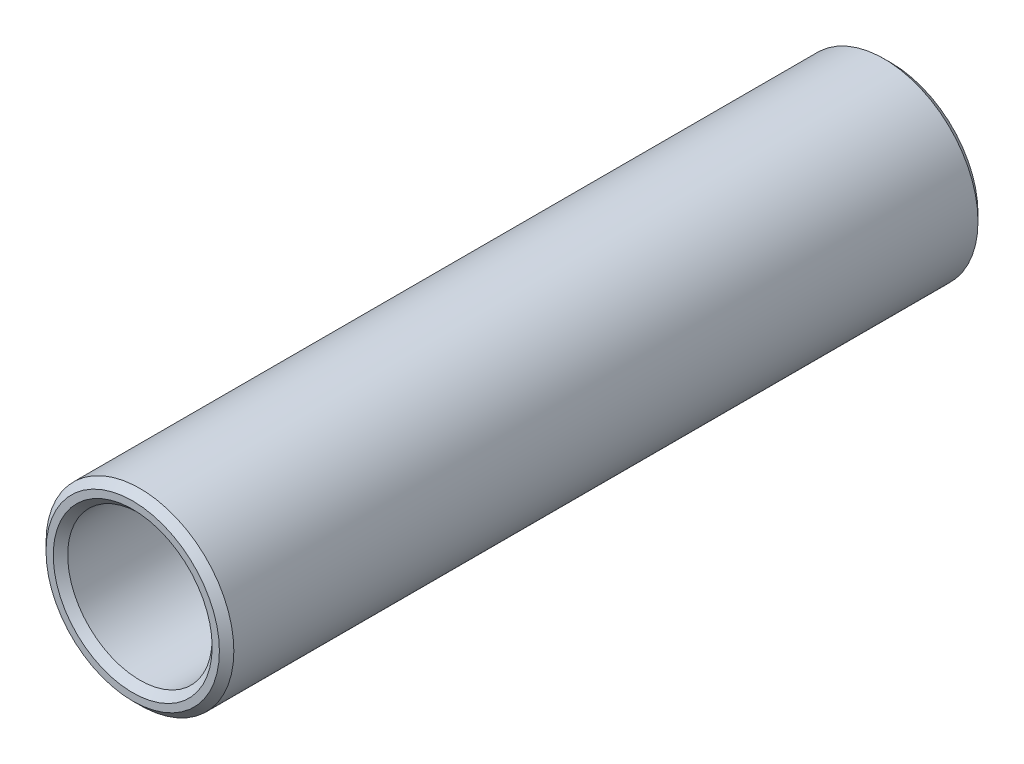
ISO-10303-21;
HEADER;
FILE_DESCRIPTION(('STEP AP214'),'2;1');
FILE_NAME('part.step','',(''),(''),'','','');
FILE_SCHEMA(('AUTOMOTIVE_DESIGN { 1 0 10303 214 1 1 1 1 }'));
ENDSEC;
DATA;
#1=APPLICATION_CONTEXT('core data for automotive mechanical design processes');
#2=APPLICATION_PROTOCOL_DEFINITION('international standard','automotive_design',2000,#1);
#3=PRODUCT_CONTEXT('',#1,'mechanical');
#4=PRODUCT('Part','Part','',(#3));
#5=PRODUCT_RELATED_PRODUCT_CATEGORY('part','',(#4));
#6=PRODUCT_DEFINITION_FORMATION('','',#4);
#7=PRODUCT_DEFINITION_CONTEXT('part definition',#1,'design');
#8=PRODUCT_DEFINITION('design','',#6,#7);
#9=PRODUCT_DEFINITION_SHAPE('','',#8);
#10=(LENGTH_UNIT() NAMED_UNIT(*) SI_UNIT(.MILLI.,.METRE.));
#11=(NAMED_UNIT(*) PLANE_ANGLE_UNIT() SI_UNIT($,.RADIAN.));
#12=(NAMED_UNIT(*) SI_UNIT($,.STERADIAN.) SOLID_ANGLE_UNIT());
#13=UNCERTAINTY_MEASURE_WITH_UNIT(LENGTH_MEASURE(1.E-05),#10,'distance_accuracy_value','');
#14=(GEOMETRIC_REPRESENTATION_CONTEXT(3) GLOBAL_UNCERTAINTY_ASSIGNED_CONTEXT((#13)) GLOBAL_UNIT_ASSIGNED_CONTEXT((#10,
#11,#12)) REPRESENTATION_CONTEXT('',''));
#15=CARTESIAN_POINT('',(0.,0.,0.));
#16=DIRECTION('',(0.,0.,1.));
#17=DIRECTION('',(1.,0.,0.));
#18=AXIS2_PLACEMENT_3D('',#15,#16,#17);
#19=CARTESIAN_POINT('',(-1.60982338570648E-12,0.,105.00000000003));
#20=DIRECTION('',(0.,0.,1.00000000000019));
#21=DIRECTION('',(1.,0.,0.));
#22=AXIS2_PLACEMENT_3D('',#19,#20,#21);
#23=PLANE('',#22);
#24=CARTESIAN_POINT('',(-1.60982338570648E-12,0.,105.00000000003));
#25=DIRECTION('',(0.,0.,1.00000000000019));
#26=DIRECTION('',(1.,0.,0.));
#27=AXIS2_PLACEMENT_3D('',#24,#25,#26);
#28=CIRCLE('',#27,11.);
#29=CARTESIAN_POINT('',(10.9999999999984,8.02635735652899E-13,105.00000000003));
#30=VERTEX_POINT('',#29);
#31=EDGE_CURVE('E55',#30,#30,#28,.F.);
#32=ORIENTED_EDGE('',*,*,#31,.T.);
#33=EDGE_LOOP('',(#32));
#34=FACE_BOUND('',#33,.T.);
#35=CARTESIAN_POINT('',(-1.60982338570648E-12,0.,105.00000000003));
#36=DIRECTION('',(0.,0.,1.00000000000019));
#37=DIRECTION('',(1.,0.,0.));
#38=AXIS2_PLACEMENT_3D('',#35,#36,#37);
#39=CIRCLE('',#38,12.);
#40=CARTESIAN_POINT('',(11.9999999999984,8.73079386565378E-13,105.00000000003));
#41=VERTEX_POINT('',#40);
#42=EDGE_CURVE('E58',#41,#41,#39,.T.);
#43=ORIENTED_EDGE('',*,*,#42,.T.);
#44=EDGE_LOOP('',(#43));
#45=FACE_BOUND('',#44,.T.);
#46=ADVANCED_FACE('F35',(#34,#45),#23,.T.);
#47=CARTESIAN_POINT('',(0.,1.11022302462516E-13,0.));
#48=DIRECTION('',(0.,0.,1.00000000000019));
#49=DIRECTION('',(1.,0.,0.));
#50=AXIS2_PLACEMENT_3D('',#47,#48,#49);
#51=PLANE('',#50);
#52=CARTESIAN_POINT('',(0.,1.11022302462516E-13,0.));
#53=DIRECTION('',(0.,0.,1.00000000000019));
#54=DIRECTION('',(1.,0.,0.));
#55=AXIS2_PLACEMENT_3D('',#52,#53,#54);
#56=CIRCLE('',#55,11.);
#57=CARTESIAN_POINT('',(11.,8.85902462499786E-13,0.));
#58=VERTEX_POINT('',#57);
#59=EDGE_CURVE('E10',#58,#58,#56,.T.);
#60=ORIENTED_EDGE('',*,*,#59,.T.);
#61=EDGE_LOOP('',(#60));
#62=FACE_BOUND('',#61,.T.);
#63=CARTESIAN_POINT('',(0.,1.11022302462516E-13,0.));
#64=DIRECTION('',(0.,0.,1.00000000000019));
#65=DIRECTION('',(1.,0.,0.));
#66=AXIS2_PLACEMENT_3D('',#63,#64,#65);
#67=CIRCLE('',#66,12.);
#68=CARTESIAN_POINT('',(12.,9.56346113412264E-13,0.));
#69=VERTEX_POINT('',#68);
#70=EDGE_CURVE('E42',#69,#69,#67,.F.);
#71=ORIENTED_EDGE('',*,*,#70,.T.);
#72=EDGE_LOOP('',(#71));
#73=FACE_BOUND('',#72,.T.);
#74=ADVANCED_FACE('F86',(#62,#73),#51,.F.);
#75=CARTESIAN_POINT('',(-1.60982338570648E-12,0.,105.00000000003));
#76=DIRECTION('',(0.,0.,-1.00000000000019));
#77=DIRECTION('',(-1.,0.,0.));
#78=AXIS2_PLACEMENT_3D('',#75,#76,#77);
#79=CYLINDRICAL_SURFACE('',#78,13.);
#80=CARTESIAN_POINT('',(0.,0.,104.00000000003));
#81=DIRECTION('',(0.,0.,1.00000000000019));
#82=DIRECTION('',(1.,0.,0.));
#83=AXIS2_PLACEMENT_3D('',#80,#81,#82);
#84=CIRCLE('',#83,13.);
#85=CARTESIAN_POINT('',(12.9999999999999,9.43523037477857E-13,104.00000000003));
#86=VERTEX_POINT('',#85);
#87=EDGE_CURVE('E46',#86,#86,#84,.F.);
#88=ORIENTED_EDGE('',*,*,#87,.T.);
#89=EDGE_LOOP('',(#88));
#90=FACE_BOUND('',#89,.T.);
#91=CARTESIAN_POINT('',(-4.02455846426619E-12,6.80011602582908E-13,1.));
#92=DIRECTION('',(0.,0.,1.00000000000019));
#93=DIRECTION('',(1.,0.,0.));
#94=AXIS2_PLACEMENT_3D('',#91,#92,#93);
#95=CIRCLE('',#94,13.);
#96=CARTESIAN_POINT('',(12.999999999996,1.59577906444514E-12,1.));
#97=VERTEX_POINT('',#96);
#98=EDGE_CURVE('E50',#97,#97,#95,.T.);
#99=ORIENTED_EDGE('',*,*,#98,.T.);
#100=EDGE_LOOP('',(#99));
#101=FACE_BOUND('',#100,.T.);
#102=ADVANCED_FACE('F37',(#90,#101),#79,.T.);
#103=CARTESIAN_POINT('',(-1.60982338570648E-12,0.,105.00000000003));
#104=DIRECTION('',(0.,0.,-1.00000000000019));
#105=DIRECTION('',(-1.,0.,0.));
#106=AXIS2_PLACEMENT_3D('',#103,#104,#105);
#107=CYLINDRICAL_SURFACE('',#106,10.);
#108=CARTESIAN_POINT('',(0.,0.,104.00000000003));
#109=DIRECTION('',(0.,0.,1.00000000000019));
#110=DIRECTION('',(1.,0.,0.));
#111=AXIS2_PLACEMENT_3D('',#108,#109,#110);
#112=CIRCLE('',#111,10.);
#113=CARTESIAN_POINT('',(9.99999999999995,7.3219208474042E-13,104.00000000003));
#114=VERTEX_POINT('',#113);
#115=EDGE_CURVE('E61',#114,#114,#112,.T.);
#116=ORIENTED_EDGE('',*,*,#115,.T.);
#117=EDGE_LOOP('',(#116));
#118=FACE_BOUND('',#117,.T.);
#119=CARTESIAN_POINT('',(-4.02455846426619E-12,6.80011602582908E-13,1.));
#120=DIRECTION('',(0.,0.,1.00000000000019));
#121=DIRECTION('',(1.,0.,0.));
#122=AXIS2_PLACEMENT_3D('',#119,#120,#121);
#123=CIRCLE('',#122,10.);
#124=CARTESIAN_POINT('',(9.99999999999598,1.3844481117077E-12,1.));
#125=VERTEX_POINT('',#124);
#126=EDGE_CURVE('E64',#125,#125,#123,.F.);
#127=ORIENTED_EDGE('',*,*,#126,.T.);
#128=EDGE_LOOP('',(#127));
#129=FACE_BOUND('',#128,.T.);
#130=ADVANCED_FACE('F68',(#118,#129),#107,.F.);
#131=CARTESIAN_POINT('',(0.,0.,104.00000000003));
#132=DIRECTION('',(0.,0.,1.00000000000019));
#133=DIRECTION('',(1.,0.,0.));
#134=AXIS2_PLACEMENT_3D('',#131,#132,#133);
#135=CONICAL_SURFACE('',#134,10.,0.785398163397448);
#136=ORIENTED_EDGE('',*,*,#31,.F.);
#137=EDGE_LOOP('',(#136));
#138=FACE_BOUND('',#137,.T.);
#139=ORIENTED_EDGE('',*,*,#115,.F.);
#140=EDGE_LOOP('',(#139));
#141=FACE_BOUND('',#140,.T.);
#142=ADVANCED_FACE('F82',(#138,#141),#135,.F.);
#143=CARTESIAN_POINT('',(-1.60982338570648E-12,0.,105.00000000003));
#144=DIRECTION('',(0.,0.,-1.00000000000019));
#145=DIRECTION('',(-1.,0.,0.));
#146=AXIS2_PLACEMENT_3D('',#143,#144,#145);
#147=CONICAL_SURFACE('',#146,12.,0.785398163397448);
#148=ORIENTED_EDGE('',*,*,#87,.F.);
#149=EDGE_LOOP('',(#148));
#150=FACE_BOUND('',#149,.T.);
#151=ORIENTED_EDGE('',*,*,#42,.F.);
#152=EDGE_LOOP('',(#151));
#153=FACE_BOUND('',#152,.T.);
#154=ADVANCED_FACE('F74',(#150,#153),#147,.T.);
#155=CARTESIAN_POINT('',(0.,1.11022302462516E-13,0.));
#156=DIRECTION('',(0.,0.,-1.00000000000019));
#157=DIRECTION('',(-1.,0.,0.));
#158=AXIS2_PLACEMENT_3D('',#155,#156,#157);
#159=CONICAL_SURFACE('',#158,11.,0.785398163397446);
#160=ORIENTED_EDGE('',*,*,#126,.F.);
#161=EDGE_LOOP('',(#160));
#162=FACE_BOUND('',#161,.T.);
#163=ORIENTED_EDGE('',*,*,#59,.F.);
#164=EDGE_LOOP('',(#163));
#165=FACE_BOUND('',#164,.T.);
#166=ADVANCED_FACE('F70',(#162,#165),#159,.F.);
#167=CARTESIAN_POINT('',(-4.02455846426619E-12,6.80011602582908E-13,1.));
#168=DIRECTION('',(0.,0.,1.00000000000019));
#169=DIRECTION('',(1.,0.,0.));
#170=AXIS2_PLACEMENT_3D('',#167,#168,#169);
#171=CONICAL_SURFACE('',#170,13.,0.78539816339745);
#172=ORIENTED_EDGE('',*,*,#70,.F.);
#173=EDGE_LOOP('',(#172));
#174=FACE_BOUND('',#173,.T.);
#175=ORIENTED_EDGE('',*,*,#98,.F.);
#176=EDGE_LOOP('',(#175));
#177=FACE_BOUND('',#176,.T.);
#178=ADVANCED_FACE('F73',(#174,#177),#171,.T.);
#179=CLOSED_SHELL('',(#46,#74,#102,#130,#142,#154,#166,#178));
#180=MANIFOLD_SOLID_BREP('B2',#179);
#181=ADVANCED_BREP_SHAPE_REPRESENTATION('',(#18,#180),#14);
#182=SHAPE_DEFINITION_REPRESENTATION(#9,#181);
ENDSEC;
END-ISO-10303-21;
